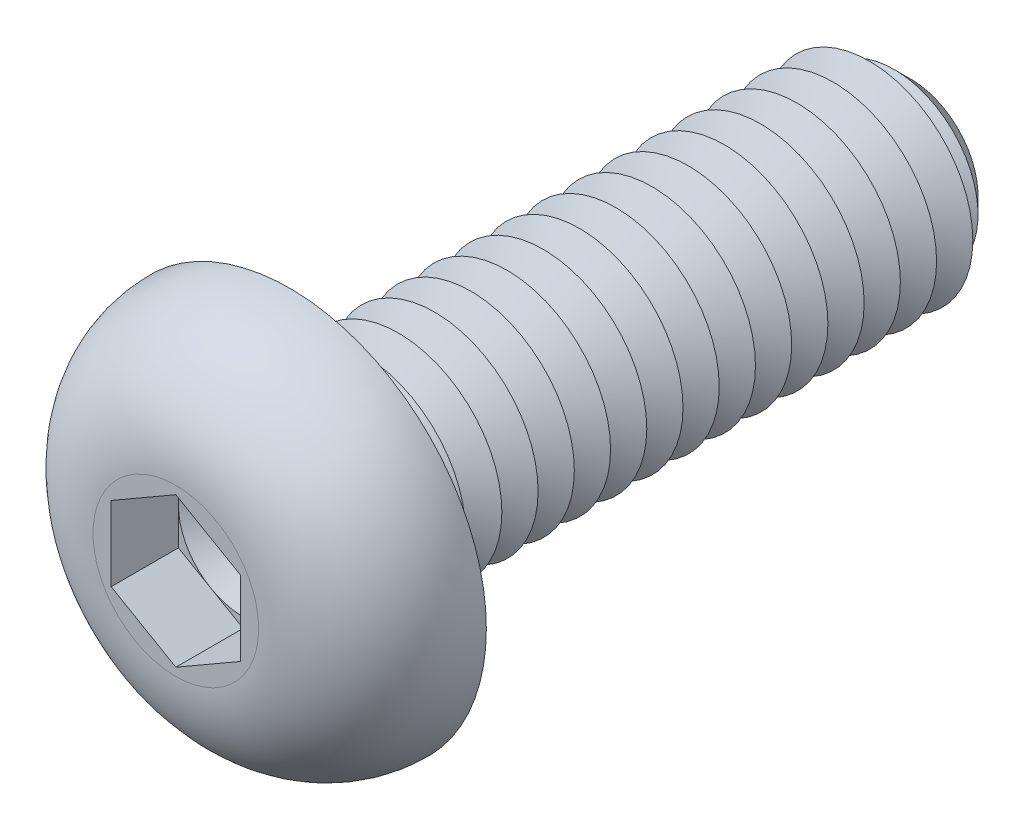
ISO-10303-21;
HEADER;
FILE_DESCRIPTION(('STEP AP214'),'2;1');
FILE_NAME('part.step','',(''),(''),'','','');
FILE_SCHEMA(('AUTOMOTIVE_DESIGN { 1 0 10303 214 1 1 1 1 }'));
ENDSEC;
DATA;
#1=APPLICATION_CONTEXT('core data for automotive mechanical design processes');
#2=APPLICATION_PROTOCOL_DEFINITION('international standard','automotive_design',2000,#1);
#3=PRODUCT_CONTEXT('',#1,'mechanical');
#4=PRODUCT('Part','Part','',(#3));
#5=PRODUCT_RELATED_PRODUCT_CATEGORY('part','',(#4));
#6=PRODUCT_DEFINITION_FORMATION('','',#4);
#7=PRODUCT_DEFINITION_CONTEXT('part definition',#1,'design');
#8=PRODUCT_DEFINITION('design','',#6,#7);
#9=PRODUCT_DEFINITION_SHAPE('','',#8);
#10=(LENGTH_UNIT() NAMED_UNIT(*) SI_UNIT(.MILLI.,.METRE.));
#11=(NAMED_UNIT(*) PLANE_ANGLE_UNIT() SI_UNIT($,.RADIAN.));
#12=(NAMED_UNIT(*) SI_UNIT($,.STERADIAN.) SOLID_ANGLE_UNIT());
#13=UNCERTAINTY_MEASURE_WITH_UNIT(LENGTH_MEASURE(1.E-05),#10,'distance_accuracy_value','');
#14=(GEOMETRIC_REPRESENTATION_CONTEXT(3) GLOBAL_UNCERTAINTY_ASSIGNED_CONTEXT((#13)) GLOBAL_UNIT_ASSIGNED_CONTEXT((#10,
#11,#12)) REPRESENTATION_CONTEXT('',''));
#15=CARTESIAN_POINT('',(0.,0.,0.));
#16=DIRECTION('',(0.,0.,1.));
#17=DIRECTION('',(1.,0.,0.));
#18=AXIS2_PLACEMENT_3D('',#15,#16,#17);
#19=CARTESIAN_POINT('',(0.,0.,0.900000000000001));
#20=DIRECTION('',(0.,0.,1.));
#21=DIRECTION('',(1.,0.,0.));
#22=AXIS2_PLACEMENT_3D('',#19,#20,#21);
#23=PLANE('',#22);
#24=CARTESIAN_POINT('',(0.,0.,0.900000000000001));
#25=DIRECTION('',(0.,0.,1.));
#26=DIRECTION('',(1.,0.,0.));
#27=AXIS2_PLACEMENT_3D('',#24,#25,#26);
#28=CIRCLE('',#27,1.25);
#29=CARTESIAN_POINT('',(1.25,0.,0.900000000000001));
#30=VERTEX_POINT('',#29);
#31=CARTESIAN_POINT('',(0.625,1.08253175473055,0.900000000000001));
#32=VERTEX_POINT('',#31);
#33=EDGE_CURVE('E117',#30,#32,#28,.T.);
#34=ORIENTED_EDGE('',*,*,#33,.F.);
#35=DIRECTION('',(0.,1.,0.));
#36=VECTOR('',#35,1.);
#37=CARTESIAN_POINT('',(1.25,-0.721687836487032,0.900000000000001));
#38=LINE('',#37,#36);
#39=CARTESIAN_POINT('',(1.25,0.721687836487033,0.900000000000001));
#40=VERTEX_POINT('',#39);
#41=EDGE_CURVE('E140',#30,#40,#38,.T.);
#42=ORIENTED_EDGE('',*,*,#41,.T.);
#43=DIRECTION('',(-0.866025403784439,0.5,0.));
#44=VECTOR('',#43,1.);
#45=CARTESIAN_POINT('',(1.25,0.721687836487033,0.900000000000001));
#46=LINE('',#45,#44);
#47=EDGE_CURVE('E135',#40,#32,#46,.T.);
#48=ORIENTED_EDGE('',*,*,#47,.T.);
#49=EDGE_LOOP('',(#34,#42,#48));
#50=FACE_BOUND('',#49,.T.);
#51=ADVANCED_FACE('F39',(#50),#23,.T.);
#52=CARTESIAN_POINT('',(0.,0.,0.900000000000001));
#53=DIRECTION('',(0.,0.,1.));
#54=DIRECTION('',(1.,0.,0.));
#55=AXIS2_PLACEMENT_3D('',#52,#53,#54);
#56=CIRCLE('',#55,1.25);
#57=CARTESIAN_POINT('',(-0.625,1.08253175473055,0.900000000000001));
#58=VERTEX_POINT('',#57);
#59=EDGE_CURVE('E11',#32,#58,#56,.T.);
#60=ORIENTED_EDGE('',*,*,#59,.F.);
#61=CARTESIAN_POINT('',(0.,1.44337567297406,0.900000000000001));
#62=VERTEX_POINT('',#61);
#63=EDGE_CURVE('E130',#32,#62,#46,.T.);
#64=ORIENTED_EDGE('',*,*,#63,.T.);
#65=DIRECTION('',(-0.866025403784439,-0.5,0.));
#66=VECTOR('',#65,1.);
#67=CARTESIAN_POINT('',(0.,1.44337567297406,0.900000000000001));
#68=LINE('',#67,#66);
#69=EDGE_CURVE('E132',#62,#58,#68,.T.);
#70=ORIENTED_EDGE('',*,*,#69,.T.);
#71=EDGE_LOOP('',(#60,#64,#70));
#72=FACE_BOUND('',#71,.T.);
#73=ADVANCED_FACE('F129',(#72),#23,.T.);
#74=CARTESIAN_POINT('',(-1.25,0.,0.900000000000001));
#75=VERTEX_POINT('',#74);
#76=EDGE_CURVE('E49',#58,#75,#56,.T.);
#77=ORIENTED_EDGE('',*,*,#76,.F.);
#78=CARTESIAN_POINT('',(-1.25,0.721687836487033,0.900000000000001));
#79=VERTEX_POINT('',#78);
#80=EDGE_CURVE('E143',#58,#79,#68,.T.);
#81=ORIENTED_EDGE('',*,*,#80,.T.);
#82=DIRECTION('',(0.,-1.,0.));
#83=VECTOR('',#82,1.);
#84=CARTESIAN_POINT('',(-1.25,0.721687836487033,0.900000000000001));
#85=LINE('',#84,#83);
#86=EDGE_CURVE('E154',#79,#75,#85,.T.);
#87=ORIENTED_EDGE('',*,*,#86,.T.);
#88=EDGE_LOOP('',(#77,#81,#87));
#89=FACE_BOUND('',#88,.T.);
#90=ADVANCED_FACE('F255',(#89),#23,.T.);
#91=CARTESIAN_POINT('',(-0.625,-1.08253175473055,0.900000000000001));
#92=VERTEX_POINT('',#91);
#93=EDGE_CURVE('E239',#75,#92,#56,.T.);
#94=ORIENTED_EDGE('',*,*,#93,.F.);
#95=CARTESIAN_POINT('',(-1.25,-0.721687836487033,0.900000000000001));
#96=VERTEX_POINT('',#95);
#97=EDGE_CURVE('E153',#75,#96,#85,.T.);
#98=ORIENTED_EDGE('',*,*,#97,.T.);
#99=DIRECTION('',(0.866025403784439,-0.5,0.));
#100=VECTOR('',#99,1.);
#101=CARTESIAN_POINT('',(-1.25,-0.721687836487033,0.900000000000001));
#102=LINE('',#101,#100);
#103=EDGE_CURVE('E159',#96,#92,#102,.T.);
#104=ORIENTED_EDGE('',*,*,#103,.T.);
#105=EDGE_LOOP('',(#94,#98,#104));
#106=FACE_BOUND('',#105,.T.);
#107=ADVANCED_FACE('F248',(#106),#23,.T.);
#108=CARTESIAN_POINT('',(0.625,-1.08253175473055,0.900000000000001));
#109=VERTEX_POINT('',#108);
#110=EDGE_CURVE('E56',#92,#109,#56,.T.);
#111=ORIENTED_EDGE('',*,*,#110,.F.);
#112=CARTESIAN_POINT('',(0.,-1.44337567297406,0.900000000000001));
#113=VERTEX_POINT('',#112);
#114=EDGE_CURVE('E158',#92,#113,#102,.T.);
#115=ORIENTED_EDGE('',*,*,#114,.T.);
#116=DIRECTION('',(0.866025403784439,0.5,0.));
#117=VECTOR('',#116,1.);
#118=CARTESIAN_POINT('',(0.,-1.44337567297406,0.900000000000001));
#119=LINE('',#118,#117);
#120=EDGE_CURVE('E164',#113,#109,#119,.T.);
#121=ORIENTED_EDGE('',*,*,#120,.T.);
#122=EDGE_LOOP('',(#111,#115,#121));
#123=FACE_BOUND('',#122,.T.);
#124=ADVANCED_FACE('F327',(#123),#23,.T.);
#125=CARTESIAN_POINT('',(0.,0.,-12.));
#126=DIRECTION('',(0.,0.,1.));
#127=DIRECTION('',(1.,0.,0.));
#128=AXIS2_PLACEMENT_3D('',#125,#126,#127);
#129=CYLINDRICAL_SURFACE('',#128,2.);
#130=CARTESIAN_POINT('',(0.,0.,-0.3));
#131=DIRECTION('',(0.,0.,1.));
#132=DIRECTION('',(1.,0.,0.));
#133=AXIS2_PLACEMENT_3D('',#130,#131,#132);
#134=CIRCLE('',#133,2.);
#135=CARTESIAN_POINT('',(2.,0.,-0.3));
#136=VERTEX_POINT('',#135);
#137=EDGE_CURVE('E221',#136,#136,#134,.F.);
#138=ORIENTED_EDGE('',*,*,#137,.T.);
#139=EDGE_LOOP('',(#138));
#140=FACE_BOUND('',#139,.T.);
#141=CARTESIAN_POINT('',(0.,0.,-0.699999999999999));
#142=DIRECTION('',(0.,0.,1.));
#143=DIRECTION('',(1.,0.,0.));
#144=AXIS2_PLACEMENT_3D('',#141,#142,#143);
#145=CIRCLE('',#144,2.);
#146=CARTESIAN_POINT('',(2.,0.,-0.699999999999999));
#147=VERTEX_POINT('',#146);
#148=EDGE_CURVE('E149',#147,#147,#145,.T.);
#149=ORIENTED_EDGE('',*,*,#148,.T.);
#150=EDGE_LOOP('',(#149));
#151=FACE_BOUND('',#150,.T.);
#152=ADVANCED_FACE('F311',(#140,#151),#129,.T.);
#153=CARTESIAN_POINT('',(0.,3.8,0.));
#154=DIRECTION('',(0.,0.,1.));
#155=DIRECTION('',(1.,0.,0.));
#156=AXIS2_PLACEMENT_3D('',#153,#154,#155);
#157=PLANE('',#156);
#158=CARTESIAN_POINT('',(0.,0.,0.));
#159=DIRECTION('',(0.,0.,1.));
#160=DIRECTION('',(1.,0.,0.));
#161=AXIS2_PLACEMENT_3D('',#158,#159,#160);
#162=CIRCLE('',#161,2.3);
#163=CARTESIAN_POINT('',(2.3,0.,0.));
#164=VERTEX_POINT('',#163);
#165=EDGE_CURVE('E230',#164,#164,#162,.T.);
#166=ORIENTED_EDGE('',*,*,#165,.T.);
#167=EDGE_LOOP('',(#166));
#168=FACE_BOUND('',#167,.T.);
#169=CARTESIAN_POINT('',(0.,0.,0.));
#170=DIRECTION('',(0.,0.,1.));
#171=DIRECTION('',(1.,0.,0.));
#172=AXIS2_PLACEMENT_3D('',#169,#170,#171);
#173=CIRCLE('',#172,3.8);
#174=CARTESIAN_POINT('',(3.8,0.,0.));
#175=VERTEX_POINT('',#174);
#176=EDGE_CURVE('E196',#175,#175,#173,.T.);
#177=ORIENTED_EDGE('',*,*,#176,.F.);
#178=EDGE_LOOP('',(#177));
#179=FACE_BOUND('',#178,.T.);
#180=ADVANCED_FACE('F357',(#168,#179),#157,.F.);
#181=CARTESIAN_POINT('',(0.,0.,2.2));
#182=DIRECTION('',(0.,0.,-1.));
#183=DIRECTION('',(-1.,0.,0.));
#184=AXIS2_PLACEMENT_3D('',#181,#182,#183);
#185=PLANE('',#184);
#186=DIRECTION('',(-0.866025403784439,-0.5,0.));
#187=VECTOR('',#186,1.);
#188=CARTESIAN_POINT('',(0.,1.44337567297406,2.2));
#189=LINE('',#188,#187);
#190=CARTESIAN_POINT('',(0.,1.44337567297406,2.2));
#191=VERTEX_POINT('',#190);
#192=CARTESIAN_POINT('',(-1.25,0.721687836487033,2.2));
#193=VERTEX_POINT('',#192);
#194=EDGE_CURVE('E174',#191,#193,#189,.T.);
#195=ORIENTED_EDGE('',*,*,#194,.F.);
#196=DIRECTION('',(-0.866025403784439,0.5,0.));
#197=VECTOR('',#196,1.);
#198=CARTESIAN_POINT('',(1.25,0.721687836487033,2.2));
#199=LINE('',#198,#197);
#200=CARTESIAN_POINT('',(1.25,0.721687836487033,2.2));
#201=VERTEX_POINT('',#200);
#202=EDGE_CURVE('E64',#201,#191,#199,.T.);
#203=ORIENTED_EDGE('',*,*,#202,.F.);
#204=DIRECTION('',(0.,1.,0.));
#205=VECTOR('',#204,1.);
#206=CARTESIAN_POINT('',(1.25,-0.721687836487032,2.2));
#207=LINE('',#206,#205);
#208=CARTESIAN_POINT('',(1.25,-0.721687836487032,2.2));
#209=VERTEX_POINT('',#208);
#210=EDGE_CURVE('E138',#209,#201,#207,.T.);
#211=ORIENTED_EDGE('',*,*,#210,.F.);
#212=DIRECTION('',(0.866025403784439,0.5,0.));
#213=VECTOR('',#212,1.);
#214=CARTESIAN_POINT('',(0.,-1.44337567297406,2.2));
#215=LINE('',#214,#213);
#216=CARTESIAN_POINT('',(0.,-1.44337567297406,2.2));
#217=VERTEX_POINT('',#216);
#218=EDGE_CURVE('E186',#217,#209,#215,.T.);
#219=ORIENTED_EDGE('',*,*,#218,.F.);
#220=DIRECTION('',(0.866025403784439,-0.5,0.));
#221=VECTOR('',#220,1.);
#222=CARTESIAN_POINT('',(-1.25,-0.721687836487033,2.2));
#223=LINE('',#222,#221);
#224=CARTESIAN_POINT('',(-1.25,-0.721687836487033,2.2));
#225=VERTEX_POINT('',#224);
#226=EDGE_CURVE('E182',#225,#217,#223,.T.);
#227=ORIENTED_EDGE('',*,*,#226,.F.);
#228=DIRECTION('',(0.,-1.,0.));
#229=VECTOR('',#228,1.);
#230=CARTESIAN_POINT('',(-1.25,0.721687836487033,2.2));
#231=LINE('',#230,#229);
#232=EDGE_CURVE('E178',#193,#225,#231,.T.);
#233=ORIENTED_EDGE('',*,*,#232,.F.);
#234=EDGE_LOOP('',(#195,#203,#211,#219,#227,#233));
#235=FACE_BOUND('',#234,.T.);
#236=CARTESIAN_POINT('',(0.,0.,2.2));
#237=DIRECTION('',(0.,0.,1.));
#238=DIRECTION('',(1.,0.,0.));
#239=AXIS2_PLACEMENT_3D('',#236,#237,#238);
#240=CIRCLE('',#239,1.6);
#241=CARTESIAN_POINT('',(1.6,0.,2.2));
#242=VERTEX_POINT('',#241);
#243=EDGE_CURVE('E213',#242,#242,#240,.T.);
#244=ORIENTED_EDGE('',*,*,#243,.T.);
#245=EDGE_LOOP('',(#244));
#246=FACE_BOUND('',#245,.T.);
#247=ADVANCED_FACE('F264',(#235,#246),#185,.F.);
#248=CARTESIAN_POINT('',(0.,0.,0.));
#249=DIRECTION('',(0.,0.,1.));
#250=DIRECTION('',(1.,0.,0.));
#251=AXIS2_PLACEMENT_3D('',#248,#249,#250);
#252=DEGENERATE_TOROIDAL_SURFACE('',#251,1.6,2.2,.T.);
#253=ORIENTED_EDGE('',*,*,#243,.F.);
#254=EDGE_LOOP('',(#253));
#255=FACE_BOUND('',#254,.T.);
#256=ORIENTED_EDGE('',*,*,#176,.T.);
#257=EDGE_LOOP('',(#256));
#258=FACE_BOUND('',#257,.T.);
#259=ADVANCED_FACE('F351',(#255,#258),#252,.T.);
#260=CARTESIAN_POINT('',(1.25,0.721687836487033,0.900000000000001));
#261=DIRECTION('',(0.5,0.866025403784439,0.));
#262=DIRECTION('',(-0.866025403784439,0.5,0.));
#263=AXIS2_PLACEMENT_3D('',#260,#261,#262);
#264=PLANE('',#263);
#265=ORIENTED_EDGE('',*,*,#202,.T.);
#266=DIRECTION('',(0.,0.,1.));
#267=VECTOR('',#266,1.);
#268=CARTESIAN_POINT('',(0.,1.44337567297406,0.900000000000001));
#269=LINE('',#268,#267);
#270=EDGE_CURVE('E136',#62,#191,#269,.T.);
#271=ORIENTED_EDGE('',*,*,#270,.F.);
#272=ORIENTED_EDGE('',*,*,#63,.F.);
#273=ORIENTED_EDGE('',*,*,#47,.F.);
#274=DIRECTION('',(0.,0.,1.));
#275=VECTOR('',#274,1.);
#276=CARTESIAN_POINT('',(1.25,0.721687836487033,0.900000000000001));
#277=LINE('',#276,#275);
#278=EDGE_CURVE('E193',#40,#201,#277,.T.);
#279=ORIENTED_EDGE('',*,*,#278,.T.);
#280=EDGE_LOOP('',(#265,#271,#272,#273,#279));
#281=FACE_BOUND('',#280,.T.);
#282=ADVANCED_FACE('F134',(#281),#264,.F.);
#283=CARTESIAN_POINT('',(1.25,-0.721687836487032,0.900000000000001));
#284=DIRECTION('',(1.,0.,0.));
#285=DIRECTION('',(0.,1.,0.));
#286=AXIS2_PLACEMENT_3D('',#283,#284,#285);
#287=PLANE('',#286);
#288=ORIENTED_EDGE('',*,*,#210,.T.);
#289=ORIENTED_EDGE('',*,*,#278,.F.);
#290=ORIENTED_EDGE('',*,*,#41,.F.);
#291=CARTESIAN_POINT('',(1.25,-0.721687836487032,0.900000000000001));
#292=VERTEX_POINT('',#291);
#293=EDGE_CURVE('E168',#292,#30,#38,.T.);
#294=ORIENTED_EDGE('',*,*,#293,.F.);
#295=DIRECTION('',(0.,0.,1.));
#296=VECTOR('',#295,1.);
#297=CARTESIAN_POINT('',(1.25,-0.721687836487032,0.900000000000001));
#298=LINE('',#297,#296);
#299=EDGE_CURVE('E197',#292,#209,#298,.T.);
#300=ORIENTED_EDGE('',*,*,#299,.T.);
#301=EDGE_LOOP('',(#288,#289,#290,#294,#300));
#302=FACE_BOUND('',#301,.T.);
#303=ADVANCED_FACE('F335',(#302),#287,.F.);
#304=CARTESIAN_POINT('',(0.,-1.44337567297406,0.900000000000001));
#305=DIRECTION('',(0.5,-0.866025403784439,0.));
#306=DIRECTION('',(0.866025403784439,0.5,0.));
#307=AXIS2_PLACEMENT_3D('',#304,#305,#306);
#308=PLANE('',#307);
#309=ORIENTED_EDGE('',*,*,#218,.T.);
#310=ORIENTED_EDGE('',*,*,#299,.F.);
#311=EDGE_CURVE('E163',#109,#292,#119,.T.);
#312=ORIENTED_EDGE('',*,*,#311,.F.);
#313=ORIENTED_EDGE('',*,*,#120,.F.);
#314=DIRECTION('',(0.,0.,1.));
#315=VECTOR('',#314,1.);
#316=CARTESIAN_POINT('',(0.,-1.44337567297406,0.900000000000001));
#317=LINE('',#316,#315);
#318=EDGE_CURVE('E200',#113,#217,#317,.T.);
#319=ORIENTED_EDGE('',*,*,#318,.T.);
#320=EDGE_LOOP('',(#309,#310,#312,#313,#319));
#321=FACE_BOUND('',#320,.T.);
#322=ADVANCED_FACE('F338',(#321),#308,.F.);
#323=CARTESIAN_POINT('',(-1.25,-0.721687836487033,0.900000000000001));
#324=DIRECTION('',(-0.5,-0.866025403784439,0.));
#325=DIRECTION('',(0.866025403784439,-0.5,0.));
#326=AXIS2_PLACEMENT_3D('',#323,#324,#325);
#327=PLANE('',#326);
#328=ORIENTED_EDGE('',*,*,#226,.T.);
#329=ORIENTED_EDGE('',*,*,#318,.F.);
#330=ORIENTED_EDGE('',*,*,#114,.F.);
#331=ORIENTED_EDGE('',*,*,#103,.F.);
#332=DIRECTION('',(0.,0.,1.));
#333=VECTOR('',#332,1.);
#334=CARTESIAN_POINT('',(-1.25,-0.721687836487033,0.900000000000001));
#335=LINE('',#334,#333);
#336=EDGE_CURVE('E203',#96,#225,#335,.T.);
#337=ORIENTED_EDGE('',*,*,#336,.T.);
#338=EDGE_LOOP('',(#328,#329,#330,#331,#337));
#339=FACE_BOUND('',#338,.T.);
#340=ADVANCED_FACE('F269',(#339),#327,.F.);
#341=CARTESIAN_POINT('',(-1.25,0.721687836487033,0.900000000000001));
#342=DIRECTION('',(-1.,0.,0.));
#343=DIRECTION('',(0.,0.,1.));
#344=AXIS2_PLACEMENT_3D('',#341,#342,#343);
#345=PLANE('',#344);
#346=ORIENTED_EDGE('',*,*,#232,.T.);
#347=ORIENTED_EDGE('',*,*,#336,.F.);
#348=ORIENTED_EDGE('',*,*,#97,.F.);
#349=ORIENTED_EDGE('',*,*,#86,.F.);
#350=DIRECTION('',(0.,0.,1.));
#351=VECTOR('',#350,1.);
#352=CARTESIAN_POINT('',(-1.25,0.721687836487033,0.900000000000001));
#353=LINE('',#352,#351);
#354=EDGE_CURVE('E206',#79,#193,#353,.T.);
#355=ORIENTED_EDGE('',*,*,#354,.T.);
#356=EDGE_LOOP('',(#346,#347,#348,#349,#355));
#357=FACE_BOUND('',#356,.T.);
#358=ADVANCED_FACE('F253',(#357),#345,.F.);
#359=CARTESIAN_POINT('',(0.,1.44337567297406,0.900000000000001));
#360=DIRECTION('',(-0.5,0.866025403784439,0.));
#361=DIRECTION('',(-0.866025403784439,-0.5,0.));
#362=AXIS2_PLACEMENT_3D('',#359,#360,#361);
#363=PLANE('',#362);
#364=ORIENTED_EDGE('',*,*,#194,.T.);
#365=ORIENTED_EDGE('',*,*,#354,.F.);
#366=ORIENTED_EDGE('',*,*,#80,.F.);
#367=ORIENTED_EDGE('',*,*,#69,.F.);
#368=ORIENTED_EDGE('',*,*,#270,.T.);
#369=EDGE_LOOP('',(#364,#365,#366,#367,#368));
#370=FACE_BOUND('',#369,.T.);
#371=ADVANCED_FACE('F258',(#370),#363,.F.);
#372=EDGE_CURVE('E43',#109,#30,#56,.T.);
#373=ORIENTED_EDGE('',*,*,#372,.F.);
#374=ORIENTED_EDGE('',*,*,#311,.T.);
#375=ORIENTED_EDGE('',*,*,#293,.T.);
#376=EDGE_LOOP('',(#373,#374,#375));
#377=FACE_BOUND('',#376,.T.);
#378=ADVANCED_FACE('F316',(#377),#23,.T.);
#379=CARTESIAN_POINT('',(0.,0.,-0.699999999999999));
#380=DIRECTION('',(0.,0.,1.));
#381=DIRECTION('',(1.,0.,0.));
#382=AXIS2_PLACEMENT_3D('',#379,#380,#381);
#383=CONICAL_SURFACE('',#382,2.,1.04719755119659);
#384=CARTESIAN_POINT('',(0.,0.,-1.05));
#385=DIRECTION('',(0.,0.,1.));
#386=DIRECTION('',(1.,0.,0.));
#387=AXIS2_PLACEMENT_3D('',#384,#385,#386);
#388=CIRCLE('',#387,1.3937822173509);
#389=CARTESIAN_POINT('',(1.3937822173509,0.,-1.05));
#390=VERTEX_POINT('',#389);
#391=EDGE_CURVE('E297',#390,#390,#388,.T.);
#392=ORIENTED_EDGE('',*,*,#391,.T.);
#393=EDGE_LOOP('',(#392));
#394=FACE_BOUND('',#393,.T.);
#395=ORIENTED_EDGE('',*,*,#148,.F.);
#396=EDGE_LOOP('',(#395));
#397=FACE_BOUND('',#396,.T.);
#398=ADVANCED_FACE('F313',(#394,#397),#383,.T.);
#399=CARTESIAN_POINT('',(0.,0.,-1.05));
#400=DIRECTION('',(0.,0.,-1.));
#401=DIRECTION('',(-1.,0.,0.));
#402=AXIS2_PLACEMENT_3D('',#399,#400,#401);
#403=CONICAL_SURFACE('',#402,1.3937822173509,1.0471975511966);
#404=CARTESIAN_POINT('',(0.,0.,-1.4));
#405=DIRECTION('',(0.,0.,1.));
#406=DIRECTION('',(1.,0.,0.));
#407=AXIS2_PLACEMENT_3D('',#404,#405,#406);
#408=CIRCLE('',#407,2.);
#409=CARTESIAN_POINT('',(2.,0.,-1.4));
#410=VERTEX_POINT('',#409);
#411=EDGE_CURVE('E290',#410,#410,#408,.T.);
#412=ORIENTED_EDGE('',*,*,#411,.T.);
#413=EDGE_LOOP('',(#412));
#414=FACE_BOUND('',#413,.T.);
#415=ORIENTED_EDGE('',*,*,#391,.F.);
#416=EDGE_LOOP('',(#415));
#417=FACE_BOUND('',#416,.T.);
#418=ADVANCED_FACE('F315',(#414,#417),#403,.T.);
#419=CARTESIAN_POINT('',(0.,0.,-1.4));
#420=DIRECTION('',(0.,0.,1.));
#421=DIRECTION('',(1.,0.,0.));
#422=AXIS2_PLACEMENT_3D('',#419,#420,#421);
#423=CONICAL_SURFACE('',#422,2.,1.04719755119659);
#424=CARTESIAN_POINT('',(0.,0.,-1.75));
#425=DIRECTION('',(0.,0.,1.));
#426=DIRECTION('',(1.,0.,0.));
#427=AXIS2_PLACEMENT_3D('',#424,#425,#426);
#428=CIRCLE('',#427,1.3937822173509);
#429=CARTESIAN_POINT('',(1.3937822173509,0.,-1.75));
#430=VERTEX_POINT('',#429);
#431=EDGE_CURVE('E288',#430,#430,#428,.T.);
#432=ORIENTED_EDGE('',*,*,#431,.T.);
#433=EDGE_LOOP('',(#432));
#434=FACE_BOUND('',#433,.T.);
#435=ORIENTED_EDGE('',*,*,#411,.F.);
#436=EDGE_LOOP('',(#435));
#437=FACE_BOUND('',#436,.T.);
#438=ADVANCED_FACE('F322',(#434,#437),#423,.T.);
#439=CARTESIAN_POINT('',(0.,0.,-1.75));
#440=DIRECTION('',(0.,0.,-1.));
#441=DIRECTION('',(-1.,0.,0.));
#442=AXIS2_PLACEMENT_3D('',#439,#440,#441);
#443=CONICAL_SURFACE('',#442,1.3937822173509,1.0471975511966);
#444=CARTESIAN_POINT('',(0.,0.,-2.1));
#445=DIRECTION('',(0.,0.,1.));
#446=DIRECTION('',(1.,0.,0.));
#447=AXIS2_PLACEMENT_3D('',#444,#445,#446);
#448=CIRCLE('',#447,2.);
#449=CARTESIAN_POINT('',(2.,0.,-2.1));
#450=VERTEX_POINT('',#449);
#451=EDGE_CURVE('E291',#450,#450,#448,.T.);
#452=ORIENTED_EDGE('',*,*,#451,.T.);
#453=EDGE_LOOP('',(#452));
#454=FACE_BOUND('',#453,.T.);
#455=ORIENTED_EDGE('',*,*,#431,.F.);
#456=EDGE_LOOP('',(#455));
#457=FACE_BOUND('',#456,.T.);
#458=ADVANCED_FACE('F484',(#454,#457),#443,.T.);
#459=CARTESIAN_POINT('',(0.,0.,-2.1));
#460=DIRECTION('',(0.,0.,1.));
#461=DIRECTION('',(1.,0.,0.));
#462=AXIS2_PLACEMENT_3D('',#459,#460,#461);
#463=CONICAL_SURFACE('',#462,2.,1.04719755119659);
#464=CARTESIAN_POINT('',(0.,0.,-2.45));
#465=DIRECTION('',(0.,0.,1.));
#466=DIRECTION('',(1.,0.,0.));
#467=AXIS2_PLACEMENT_3D('',#464,#465,#466);
#468=CIRCLE('',#467,1.3937822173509);
#469=CARTESIAN_POINT('',(1.3937822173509,0.,-2.45));
#470=VERTEX_POINT('',#469);
#471=EDGE_CURVE('E300',#470,#470,#468,.T.);
#472=ORIENTED_EDGE('',*,*,#471,.T.);
#473=EDGE_LOOP('',(#472));
#474=FACE_BOUND('',#473,.T.);
#475=ORIENTED_EDGE('',*,*,#451,.F.);
#476=EDGE_LOOP('',(#475));
#477=FACE_BOUND('',#476,.T.);
#478=ADVANCED_FACE('F469',(#474,#477),#463,.T.);
#479=CARTESIAN_POINT('',(0.,0.,-2.45));
#480=DIRECTION('',(0.,0.,-1.));
#481=DIRECTION('',(-1.,0.,0.));
#482=AXIS2_PLACEMENT_3D('',#479,#480,#481);
#483=CONICAL_SURFACE('',#482,1.3937822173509,1.0471975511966);
#484=CARTESIAN_POINT('',(0.,0.,-2.8));
#485=DIRECTION('',(0.,0.,1.));
#486=DIRECTION('',(1.,0.,0.));
#487=AXIS2_PLACEMENT_3D('',#484,#485,#486);
#488=CIRCLE('',#487,2.);
#489=CARTESIAN_POINT('',(2.,0.,-2.8));
#490=VERTEX_POINT('',#489);
#491=EDGE_CURVE('E285',#490,#490,#488,.T.);
#492=ORIENTED_EDGE('',*,*,#491,.T.);
#493=EDGE_LOOP('',(#492));
#494=FACE_BOUND('',#493,.T.);
#495=ORIENTED_EDGE('',*,*,#471,.F.);
#496=EDGE_LOOP('',(#495));
#497=FACE_BOUND('',#496,.T.);
#498=ADVANCED_FACE('F472',(#494,#497),#483,.T.);
#499=CARTESIAN_POINT('',(0.,0.,-2.8));
#500=DIRECTION('',(0.,0.,1.));
#501=DIRECTION('',(1.,0.,0.));
#502=AXIS2_PLACEMENT_3D('',#499,#500,#501);
#503=CONICAL_SURFACE('',#502,2.,1.04719755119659);
#504=CARTESIAN_POINT('',(0.,0.,-3.15));
#505=DIRECTION('',(0.,0.,1.));
#506=DIRECTION('',(1.,0.,0.));
#507=AXIS2_PLACEMENT_3D('',#504,#505,#506);
#508=CIRCLE('',#507,1.3937822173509);
#509=CARTESIAN_POINT('',(1.3937822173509,0.,-3.15));
#510=VERTEX_POINT('',#509);
#511=EDGE_CURVE('E282',#510,#510,#508,.T.);
#512=ORIENTED_EDGE('',*,*,#511,.T.);
#513=EDGE_LOOP('',(#512));
#514=FACE_BOUND('',#513,.T.);
#515=ORIENTED_EDGE('',*,*,#491,.F.);
#516=EDGE_LOOP('',(#515));
#517=FACE_BOUND('',#516,.T.);
#518=ADVANCED_FACE('F474',(#514,#517),#503,.T.);
#519=CARTESIAN_POINT('',(0.,0.,-3.15));
#520=DIRECTION('',(0.,0.,-1.));
#521=DIRECTION('',(-1.,0.,0.));
#522=AXIS2_PLACEMENT_3D('',#519,#520,#521);
#523=CONICAL_SURFACE('',#522,1.3937822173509,1.0471975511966);
#524=CARTESIAN_POINT('',(0.,0.,-3.5));
#525=DIRECTION('',(0.,0.,1.));
#526=DIRECTION('',(1.,0.,0.));
#527=AXIS2_PLACEMENT_3D('',#524,#525,#526);
#528=CIRCLE('',#527,2.);
#529=CARTESIAN_POINT('',(2.,0.,-3.5));
#530=VERTEX_POINT('',#529);
#531=EDGE_CURVE('E286',#530,#530,#528,.T.);
#532=ORIENTED_EDGE('',*,*,#531,.T.);
#533=EDGE_LOOP('',(#532));
#534=FACE_BOUND('',#533,.T.);
#535=ORIENTED_EDGE('',*,*,#511,.F.);
#536=EDGE_LOOP('',(#535));
#537=FACE_BOUND('',#536,.T.);
#538=ADVANCED_FACE('F481',(#534,#537),#523,.T.);
#539=CARTESIAN_POINT('',(0.,0.,-3.5));
#540=DIRECTION('',(0.,0.,1.));
#541=DIRECTION('',(1.,0.,0.));
#542=AXIS2_PLACEMENT_3D('',#539,#540,#541);
#543=CONICAL_SURFACE('',#542,2.,1.04719755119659);
#544=CARTESIAN_POINT('',(0.,0.,-3.85));
#545=DIRECTION('',(0.,0.,1.));
#546=DIRECTION('',(1.,0.,0.));
#547=AXIS2_PLACEMENT_3D('',#544,#545,#546);
#548=CIRCLE('',#547,1.3937822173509);
#549=CARTESIAN_POINT('',(1.3937822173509,0.,-3.85));
#550=VERTEX_POINT('',#549);
#551=EDGE_CURVE('E456',#550,#550,#548,.T.);
#552=ORIENTED_EDGE('',*,*,#551,.T.);
#553=EDGE_LOOP('',(#552));
#554=FACE_BOUND('',#553,.T.);
#555=ORIENTED_EDGE('',*,*,#531,.F.);
#556=EDGE_LOOP('',(#555));
#557=FACE_BOUND('',#556,.T.);
#558=ADVANCED_FACE('F520',(#554,#557),#543,.T.);
#559=CARTESIAN_POINT('',(0.,0.,-3.85));
#560=DIRECTION('',(0.,0.,-1.));
#561=DIRECTION('',(-1.,0.,0.));
#562=AXIS2_PLACEMENT_3D('',#559,#560,#561);
#563=CONICAL_SURFACE('',#562,1.3937822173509,1.0471975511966);
#564=CARTESIAN_POINT('',(0.,0.,-4.2));
#565=DIRECTION('',(0.,0.,1.));
#566=DIRECTION('',(1.,0.,0.));
#567=AXIS2_PLACEMENT_3D('',#564,#565,#566);
#568=CIRCLE('',#567,2.);
#569=CARTESIAN_POINT('',(2.,0.,-4.2));
#570=VERTEX_POINT('',#569);
#571=EDGE_CURVE('E452',#570,#570,#568,.T.);
#572=ORIENTED_EDGE('',*,*,#571,.T.);
#573=EDGE_LOOP('',(#572));
#574=FACE_BOUND('',#573,.T.);
#575=ORIENTED_EDGE('',*,*,#551,.F.);
#576=EDGE_LOOP('',(#575));
#577=FACE_BOUND('',#576,.T.);
#578=ADVANCED_FACE('F528',(#574,#577),#563,.T.);
#579=CARTESIAN_POINT('',(0.,0.,-4.2));
#580=DIRECTION('',(0.,0.,1.));
#581=DIRECTION('',(1.,0.,0.));
#582=AXIS2_PLACEMENT_3D('',#579,#580,#581);
#583=CONICAL_SURFACE('',#582,2.,1.04719755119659);
#584=CARTESIAN_POINT('',(0.,0.,-4.55));
#585=DIRECTION('',(0.,0.,1.));
#586=DIRECTION('',(1.,0.,0.));
#587=AXIS2_PLACEMENT_3D('',#584,#585,#586);
#588=CIRCLE('',#587,1.3937822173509);
#589=CARTESIAN_POINT('',(1.3937822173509,0.,-4.55));
#590=VERTEX_POINT('',#589);
#591=EDGE_CURVE('E449',#590,#590,#588,.T.);
#592=ORIENTED_EDGE('',*,*,#591,.T.);
#593=EDGE_LOOP('',(#592));
#594=FACE_BOUND('',#593,.T.);
#595=ORIENTED_EDGE('',*,*,#571,.F.);
#596=EDGE_LOOP('',(#595));
#597=FACE_BOUND('',#596,.T.);
#598=ADVANCED_FACE('F537',(#594,#597),#583,.T.);
#599=CARTESIAN_POINT('',(0.,0.,-4.55));
#600=DIRECTION('',(0.,0.,-1.));
#601=DIRECTION('',(-1.,0.,0.));
#602=AXIS2_PLACEMENT_3D('',#599,#600,#601);
#603=CONICAL_SURFACE('',#602,1.3937822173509,1.0471975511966);
#604=CARTESIAN_POINT('',(0.,0.,-4.9));
#605=DIRECTION('',(0.,0.,1.));
#606=DIRECTION('',(1.,0.,0.));
#607=AXIS2_PLACEMENT_3D('',#604,#605,#606);
#608=CIRCLE('',#607,2.);
#609=CARTESIAN_POINT('',(2.,0.,-4.9));
#610=VERTEX_POINT('',#609);
#611=EDGE_CURVE('E445',#610,#610,#608,.T.);
#612=ORIENTED_EDGE('',*,*,#611,.T.);
#613=EDGE_LOOP('',(#612));
#614=FACE_BOUND('',#613,.T.);
#615=ORIENTED_EDGE('',*,*,#591,.F.);
#616=EDGE_LOOP('',(#615));
#617=FACE_BOUND('',#616,.T.);
#618=ADVANCED_FACE('F546',(#614,#617),#603,.T.);
#619=CARTESIAN_POINT('',(0.,0.,-4.9));
#620=DIRECTION('',(0.,0.,1.));
#621=DIRECTION('',(1.,0.,0.));
#622=AXIS2_PLACEMENT_3D('',#619,#620,#621);
#623=CONICAL_SURFACE('',#622,2.,1.04719755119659);
#624=CARTESIAN_POINT('',(0.,0.,-5.25));
#625=DIRECTION('',(0.,0.,1.));
#626=DIRECTION('',(1.,0.,0.));
#627=AXIS2_PLACEMENT_3D('',#624,#625,#626);
#628=CIRCLE('',#627,1.3937822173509);
#629=CARTESIAN_POINT('',(1.3937822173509,0.,-5.25));
#630=VERTEX_POINT('',#629);
#631=EDGE_CURVE('E441',#630,#630,#628,.T.);
#632=ORIENTED_EDGE('',*,*,#631,.T.);
#633=EDGE_LOOP('',(#632));
#634=FACE_BOUND('',#633,.T.);
#635=ORIENTED_EDGE('',*,*,#611,.F.);
#636=EDGE_LOOP('',(#635));
#637=FACE_BOUND('',#636,.T.);
#638=ADVANCED_FACE('F555',(#634,#637),#623,.T.);
#639=CARTESIAN_POINT('',(0.,0.,-5.25));
#640=DIRECTION('',(0.,0.,-1.));
#641=DIRECTION('',(-1.,0.,0.));
#642=AXIS2_PLACEMENT_3D('',#639,#640,#641);
#643=CONICAL_SURFACE('',#642,1.3937822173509,1.0471975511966);
#644=CARTESIAN_POINT('',(0.,0.,-5.6));
#645=DIRECTION('',(0.,0.,1.));
#646=DIRECTION('',(1.,0.,0.));
#647=AXIS2_PLACEMENT_3D('',#644,#645,#646);
#648=CIRCLE('',#647,2.);
#649=CARTESIAN_POINT('',(2.,0.,-5.6));
#650=VERTEX_POINT('',#649);
#651=EDGE_CURVE('E437',#650,#650,#648,.T.);
#652=ORIENTED_EDGE('',*,*,#651,.T.);
#653=EDGE_LOOP('',(#652));
#654=FACE_BOUND('',#653,.T.);
#655=ORIENTED_EDGE('',*,*,#631,.F.);
#656=EDGE_LOOP('',(#655));
#657=FACE_BOUND('',#656,.T.);
#658=ADVANCED_FACE('F564',(#654,#657),#643,.T.);
#659=CARTESIAN_POINT('',(0.,0.,-5.6));
#660=DIRECTION('',(0.,0.,1.));
#661=DIRECTION('',(1.,0.,0.));
#662=AXIS2_PLACEMENT_3D('',#659,#660,#661);
#663=CONICAL_SURFACE('',#662,2.,1.04719755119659);
#664=CARTESIAN_POINT('',(0.,0.,-5.95));
#665=DIRECTION('',(0.,0.,1.));
#666=DIRECTION('',(1.,0.,0.));
#667=AXIS2_PLACEMENT_3D('',#664,#665,#666);
#668=CIRCLE('',#667,1.3937822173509);
#669=CARTESIAN_POINT('',(1.3937822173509,0.,-5.95));
#670=VERTEX_POINT('',#669);
#671=EDGE_CURVE('E433',#670,#670,#668,.T.);
#672=ORIENTED_EDGE('',*,*,#671,.T.);
#673=EDGE_LOOP('',(#672));
#674=FACE_BOUND('',#673,.T.);
#675=ORIENTED_EDGE('',*,*,#651,.F.);
#676=EDGE_LOOP('',(#675));
#677=FACE_BOUND('',#676,.T.);
#678=ADVANCED_FACE('F573',(#674,#677),#663,.T.);
#679=CARTESIAN_POINT('',(0.,0.,-5.95));
#680=DIRECTION('',(0.,0.,-1.));
#681=DIRECTION('',(-1.,0.,0.));
#682=AXIS2_PLACEMENT_3D('',#679,#680,#681);
#683=CONICAL_SURFACE('',#682,1.3937822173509,1.0471975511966);
#684=CARTESIAN_POINT('',(0.,0.,-6.3));
#685=DIRECTION('',(0.,0.,1.));
#686=DIRECTION('',(1.,0.,0.));
#687=AXIS2_PLACEMENT_3D('',#684,#685,#686);
#688=CIRCLE('',#687,2.);
#689=CARTESIAN_POINT('',(2.,0.,-6.3));
#690=VERTEX_POINT('',#689);
#691=EDGE_CURVE('E430',#690,#690,#688,.T.);
#692=ORIENTED_EDGE('',*,*,#691,.T.);
#693=EDGE_LOOP('',(#692));
#694=FACE_BOUND('',#693,.T.);
#695=ORIENTED_EDGE('',*,*,#671,.F.);
#696=EDGE_LOOP('',(#695));
#697=FACE_BOUND('',#696,.T.);
#698=ADVANCED_FACE('F582',(#694,#697),#683,.T.);
#699=CARTESIAN_POINT('',(0.,0.,-6.3));
#700=DIRECTION('',(0.,0.,1.));
#701=DIRECTION('',(1.,0.,0.));
#702=AXIS2_PLACEMENT_3D('',#699,#700,#701);
#703=CONICAL_SURFACE('',#702,2.,1.04719755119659);
#704=CARTESIAN_POINT('',(0.,0.,-6.65));
#705=DIRECTION('',(0.,0.,1.));
#706=DIRECTION('',(1.,0.,0.));
#707=AXIS2_PLACEMENT_3D('',#704,#705,#706);
#708=CIRCLE('',#707,1.3937822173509);
#709=CARTESIAN_POINT('',(1.3937822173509,0.,-6.65));
#710=VERTEX_POINT('',#709);
#711=EDGE_CURVE('E426',#710,#710,#708,.T.);
#712=ORIENTED_EDGE('',*,*,#711,.T.);
#713=EDGE_LOOP('',(#712));
#714=FACE_BOUND('',#713,.T.);
#715=ORIENTED_EDGE('',*,*,#691,.F.);
#716=EDGE_LOOP('',(#715));
#717=FACE_BOUND('',#716,.T.);
#718=ADVANCED_FACE('F591',(#714,#717),#703,.T.);
#719=CARTESIAN_POINT('',(0.,0.,-6.65));
#720=DIRECTION('',(0.,0.,-1.));
#721=DIRECTION('',(-1.,0.,0.));
#722=AXIS2_PLACEMENT_3D('',#719,#720,#721);
#723=CONICAL_SURFACE('',#722,1.3937822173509,1.0471975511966);
#724=CARTESIAN_POINT('',(0.,0.,-7.));
#725=DIRECTION('',(0.,0.,1.));
#726=DIRECTION('',(1.,0.,0.));
#727=AXIS2_PLACEMENT_3D('',#724,#725,#726);
#728=CIRCLE('',#727,2.);
#729=CARTESIAN_POINT('',(2.,0.,-7.));
#730=VERTEX_POINT('',#729);
#731=EDGE_CURVE('E423',#730,#730,#728,.T.);
#732=ORIENTED_EDGE('',*,*,#731,.T.);
#733=EDGE_LOOP('',(#732));
#734=FACE_BOUND('',#733,.T.);
#735=ORIENTED_EDGE('',*,*,#711,.F.);
#736=EDGE_LOOP('',(#735));
#737=FACE_BOUND('',#736,.T.);
#738=ADVANCED_FACE('F600',(#734,#737),#723,.T.);
#739=CARTESIAN_POINT('',(0.,0.,-7.));
#740=DIRECTION('',(0.,0.,1.));
#741=DIRECTION('',(1.,0.,0.));
#742=AXIS2_PLACEMENT_3D('',#739,#740,#741);
#743=CONICAL_SURFACE('',#742,2.,1.04719755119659);
#744=CARTESIAN_POINT('',(0.,0.,-7.35));
#745=DIRECTION('',(0.,0.,1.));
#746=DIRECTION('',(1.,0.,0.));
#747=AXIS2_PLACEMENT_3D('',#744,#745,#746);
#748=CIRCLE('',#747,1.3937822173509);
#749=CARTESIAN_POINT('',(1.3937822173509,0.,-7.35));
#750=VERTEX_POINT('',#749);
#751=EDGE_CURVE('E419',#750,#750,#748,.T.);
#752=ORIENTED_EDGE('',*,*,#751,.T.);
#753=EDGE_LOOP('',(#752));
#754=FACE_BOUND('',#753,.T.);
#755=ORIENTED_EDGE('',*,*,#731,.F.);
#756=EDGE_LOOP('',(#755));
#757=FACE_BOUND('',#756,.T.);
#758=ADVANCED_FACE('F609',(#754,#757),#743,.T.);
#759=CARTESIAN_POINT('',(0.,0.,-7.35));
#760=DIRECTION('',(0.,0.,-1.));
#761=DIRECTION('',(-1.,0.,0.));
#762=AXIS2_PLACEMENT_3D('',#759,#760,#761);
#763=CONICAL_SURFACE('',#762,1.3937822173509,1.0471975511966);
#764=CARTESIAN_POINT('',(0.,0.,-7.7));
#765=DIRECTION('',(0.,0.,1.));
#766=DIRECTION('',(1.,0.,0.));
#767=AXIS2_PLACEMENT_3D('',#764,#765,#766);
#768=CIRCLE('',#767,2.);
#769=CARTESIAN_POINT('',(2.,0.,-7.7));
#770=VERTEX_POINT('',#769);
#771=EDGE_CURVE('E415',#770,#770,#768,.T.);
#772=ORIENTED_EDGE('',*,*,#771,.T.);
#773=EDGE_LOOP('',(#772));
#774=FACE_BOUND('',#773,.T.);
#775=ORIENTED_EDGE('',*,*,#751,.F.);
#776=EDGE_LOOP('',(#775));
#777=FACE_BOUND('',#776,.T.);
#778=ADVANCED_FACE('F618',(#774,#777),#763,.T.);
#779=CARTESIAN_POINT('',(0.,0.,-7.7));
#780=DIRECTION('',(0.,0.,1.));
#781=DIRECTION('',(1.,0.,0.));
#782=AXIS2_PLACEMENT_3D('',#779,#780,#781);
#783=CONICAL_SURFACE('',#782,2.,1.04719755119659);
#784=CARTESIAN_POINT('',(0.,0.,-8.05));
#785=DIRECTION('',(0.,0.,1.));
#786=DIRECTION('',(1.,0.,0.));
#787=AXIS2_PLACEMENT_3D('',#784,#785,#786);
#788=CIRCLE('',#787,1.3937822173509);
#789=CARTESIAN_POINT('',(1.3937822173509,0.,-8.05));
#790=VERTEX_POINT('',#789);
#791=EDGE_CURVE('E411',#790,#790,#788,.T.);
#792=ORIENTED_EDGE('',*,*,#791,.T.);
#793=EDGE_LOOP('',(#792));
#794=FACE_BOUND('',#793,.T.);
#795=ORIENTED_EDGE('',*,*,#771,.F.);
#796=EDGE_LOOP('',(#795));
#797=FACE_BOUND('',#796,.T.);
#798=ADVANCED_FACE('F627',(#794,#797),#783,.T.);
#799=CARTESIAN_POINT('',(0.,0.,-8.05));
#800=DIRECTION('',(0.,0.,-1.));
#801=DIRECTION('',(-1.,0.,0.));
#802=AXIS2_PLACEMENT_3D('',#799,#800,#801);
#803=CONICAL_SURFACE('',#802,1.3937822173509,1.0471975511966);
#804=CARTESIAN_POINT('',(0.,0.,-8.4));
#805=DIRECTION('',(0.,0.,1.));
#806=DIRECTION('',(1.,0.,0.));
#807=AXIS2_PLACEMENT_3D('',#804,#805,#806);
#808=CIRCLE('',#807,2.);
#809=CARTESIAN_POINT('',(2.,0.,-8.4));
#810=VERTEX_POINT('',#809);
#811=EDGE_CURVE('E407',#810,#810,#808,.T.);
#812=ORIENTED_EDGE('',*,*,#811,.T.);
#813=EDGE_LOOP('',(#812));
#814=FACE_BOUND('',#813,.T.);
#815=ORIENTED_EDGE('',*,*,#791,.F.);
#816=EDGE_LOOP('',(#815));
#817=FACE_BOUND('',#816,.T.);
#818=ADVANCED_FACE('F636',(#814,#817),#803,.T.);
#819=CARTESIAN_POINT('',(0.,0.,-8.4));
#820=DIRECTION('',(0.,0.,1.));
#821=DIRECTION('',(1.,0.,0.));
#822=AXIS2_PLACEMENT_3D('',#819,#820,#821);
#823=CONICAL_SURFACE('',#822,2.,1.04719755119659);
#824=CARTESIAN_POINT('',(0.,0.,-8.75));
#825=DIRECTION('',(0.,0.,1.));
#826=DIRECTION('',(1.,0.,0.));
#827=AXIS2_PLACEMENT_3D('',#824,#825,#826);
#828=CIRCLE('',#827,1.3937822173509);
#829=CARTESIAN_POINT('',(1.3937822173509,0.,-8.75));
#830=VERTEX_POINT('',#829);
#831=EDGE_CURVE('E404',#830,#830,#828,.T.);
#832=ORIENTED_EDGE('',*,*,#831,.T.);
#833=EDGE_LOOP('',(#832));
#834=FACE_BOUND('',#833,.T.);
#835=ORIENTED_EDGE('',*,*,#811,.F.);
#836=EDGE_LOOP('',(#835));
#837=FACE_BOUND('',#836,.T.);
#838=ADVANCED_FACE('F645',(#834,#837),#823,.T.);
#839=CARTESIAN_POINT('',(0.,0.,-8.75));
#840=DIRECTION('',(0.,0.,-1.));
#841=DIRECTION('',(-1.,0.,0.));
#842=AXIS2_PLACEMENT_3D('',#839,#840,#841);
#843=CONICAL_SURFACE('',#842,1.3937822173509,1.0471975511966);
#844=CARTESIAN_POINT('',(0.,0.,-9.1));
#845=DIRECTION('',(0.,0.,1.));
#846=DIRECTION('',(1.,0.,0.));
#847=AXIS2_PLACEMENT_3D('',#844,#845,#846);
#848=CIRCLE('',#847,2.);
#849=CARTESIAN_POINT('',(2.,0.,-9.1));
#850=VERTEX_POINT('',#849);
#851=EDGE_CURVE('E400',#850,#850,#848,.T.);
#852=ORIENTED_EDGE('',*,*,#851,.T.);
#853=EDGE_LOOP('',(#852));
#854=FACE_BOUND('',#853,.T.);
#855=ORIENTED_EDGE('',*,*,#831,.F.);
#856=EDGE_LOOP('',(#855));
#857=FACE_BOUND('',#856,.T.);
#858=ADVANCED_FACE('F654',(#854,#857),#843,.T.);
#859=CARTESIAN_POINT('',(0.,0.,-9.1));
#860=DIRECTION('',(0.,0.,1.));
#861=DIRECTION('',(1.,0.,0.));
#862=AXIS2_PLACEMENT_3D('',#859,#860,#861);
#863=CONICAL_SURFACE('',#862,2.,1.04719755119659);
#864=CARTESIAN_POINT('',(0.,0.,-9.45));
#865=DIRECTION('',(0.,0.,1.));
#866=DIRECTION('',(1.,0.,0.));
#867=AXIS2_PLACEMENT_3D('',#864,#865,#866);
#868=CIRCLE('',#867,1.3937822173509);
#869=CARTESIAN_POINT('',(1.3937822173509,0.,-9.45));
#870=VERTEX_POINT('',#869);
#871=EDGE_CURVE('E279',#870,#870,#868,.T.);
#872=ORIENTED_EDGE('',*,*,#871,.T.);
#873=EDGE_LOOP('',(#872));
#874=FACE_BOUND('',#873,.T.);
#875=ORIENTED_EDGE('',*,*,#851,.F.);
#876=EDGE_LOOP('',(#875));
#877=FACE_BOUND('',#876,.T.);
#878=ADVANCED_FACE('F663',(#874,#877),#863,.T.);
#879=CARTESIAN_POINT('',(0.,0.,-9.45));
#880=DIRECTION('',(0.,0.,-1.));
#881=DIRECTION('',(-1.,0.,0.));
#882=AXIS2_PLACEMENT_3D('',#879,#880,#881);
#883=CONICAL_SURFACE('',#882,1.3937822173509,1.0471975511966);
#884=CARTESIAN_POINT('',(0.,0.,-9.8));
#885=DIRECTION('',(0.,0.,1.));
#886=DIRECTION('',(1.,0.,0.));
#887=AXIS2_PLACEMENT_3D('',#884,#885,#886);
#888=CIRCLE('',#887,2.);
#889=CARTESIAN_POINT('',(2.,0.,-9.8));
#890=VERTEX_POINT('',#889);
#891=EDGE_CURVE('E276',#890,#890,#888,.T.);
#892=ORIENTED_EDGE('',*,*,#891,.T.);
#893=EDGE_LOOP('',(#892));
#894=FACE_BOUND('',#893,.T.);
#895=ORIENTED_EDGE('',*,*,#871,.F.);
#896=EDGE_LOOP('',(#895));
#897=FACE_BOUND('',#896,.T.);
#898=ADVANCED_FACE('F672',(#894,#897),#883,.T.);
#899=CARTESIAN_POINT('',(0.,0.,-9.8));
#900=DIRECTION('',(0.,0.,1.));
#901=DIRECTION('',(1.,0.,0.));
#902=AXIS2_PLACEMENT_3D('',#899,#900,#901);
#903=CONICAL_SURFACE('',#902,2.,1.04719755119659);
#904=CARTESIAN_POINT('',(0.,0.,-10.15));
#905=DIRECTION('',(0.,0.,1.));
#906=DIRECTION('',(1.,0.,0.));
#907=AXIS2_PLACEMENT_3D('',#904,#905,#906);
#908=CIRCLE('',#907,1.3937822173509);
#909=CARTESIAN_POINT('',(1.3937822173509,0.,-10.15));
#910=VERTEX_POINT('',#909);
#911=EDGE_CURVE('E280',#910,#910,#908,.T.);
#912=ORIENTED_EDGE('',*,*,#911,.T.);
#913=EDGE_LOOP('',(#912));
#914=FACE_BOUND('',#913,.T.);
#915=ORIENTED_EDGE('',*,*,#891,.F.);
#916=EDGE_LOOP('',(#915));
#917=FACE_BOUND('',#916,.T.);
#918=ADVANCED_FACE('F681',(#914,#917),#903,.T.);
#919=CARTESIAN_POINT('',(0.,0.,-10.15));
#920=DIRECTION('',(0.,0.,-1.));
#921=DIRECTION('',(-1.,0.,0.));
#922=AXIS2_PLACEMENT_3D('',#919,#920,#921);
#923=CONICAL_SURFACE('',#922,1.3937822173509,1.0471975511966);
#924=CARTESIAN_POINT('',(0.,0.,-10.5));
#925=DIRECTION('',(0.,0.,1.));
#926=DIRECTION('',(1.,0.,0.));
#927=AXIS2_PLACEMENT_3D('',#924,#925,#926);
#928=CIRCLE('',#927,2.);
#929=CARTESIAN_POINT('',(2.,0.,-10.5));
#930=VERTEX_POINT('',#929);
#931=EDGE_CURVE('E391',#930,#930,#928,.T.);
#932=ORIENTED_EDGE('',*,*,#931,.T.);
#933=EDGE_LOOP('',(#932));
#934=FACE_BOUND('',#933,.T.);
#935=ORIENTED_EDGE('',*,*,#911,.F.);
#936=EDGE_LOOP('',(#935));
#937=FACE_BOUND('',#936,.T.);
#938=ADVANCED_FACE('F690',(#934,#937),#923,.T.);
#939=CARTESIAN_POINT('',(0.,0.,-10.5));
#940=DIRECTION('',(0.,0.,1.));
#941=DIRECTION('',(1.,0.,0.));
#942=AXIS2_PLACEMENT_3D('',#939,#940,#941);
#943=CONICAL_SURFACE('',#942,2.,1.04719755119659);
#944=CARTESIAN_POINT('',(0.,0.,-10.85));
#945=DIRECTION('',(0.,0.,1.));
#946=DIRECTION('',(1.,0.,0.));
#947=AXIS2_PLACEMENT_3D('',#944,#945,#946);
#948=CIRCLE('',#947,1.3937822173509);
#949=CARTESIAN_POINT('',(1.3937822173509,0.,-10.85));
#950=VERTEX_POINT('',#949);
#951=EDGE_CURVE('E226',#950,#950,#948,.T.);
#952=ORIENTED_EDGE('',*,*,#951,.T.);
#953=EDGE_LOOP('',(#952));
#954=FACE_BOUND('',#953,.T.);
#955=ORIENTED_EDGE('',*,*,#931,.F.);
#956=EDGE_LOOP('',(#955));
#957=FACE_BOUND('',#956,.T.);
#958=ADVANCED_FACE('F699',(#954,#957),#943,.T.);
#959=CARTESIAN_POINT('',(0.,0.,-10.85));
#960=DIRECTION('',(0.,0.,-1.));
#961=DIRECTION('',(-1.,0.,0.));
#962=AXIS2_PLACEMENT_3D('',#959,#960,#961);
#963=CONICAL_SURFACE('',#962,1.3937822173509,1.0471975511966);
#964=CARTESIAN_POINT('',(0.,0.,-11.2));
#965=DIRECTION('',(0.,0.,1.));
#966=DIRECTION('',(1.,0.,0.));
#967=AXIS2_PLACEMENT_3D('',#964,#965,#966);
#968=CIRCLE('',#967,2.);
#969=CARTESIAN_POINT('',(2.,0.,-11.2));
#970=VERTEX_POINT('',#969);
#971=EDGE_CURVE('E227',#970,#970,#968,.T.);
#972=ORIENTED_EDGE('',*,*,#971,.T.);
#973=EDGE_LOOP('',(#972));
#974=FACE_BOUND('',#973,.T.);
#975=ORIENTED_EDGE('',*,*,#951,.F.);
#976=EDGE_LOOP('',(#975));
#977=FACE_BOUND('',#976,.T.);
#978=ADVANCED_FACE('F708',(#974,#977),#963,.T.);
#979=CARTESIAN_POINT('',(0.,0.,-11.2));
#980=DIRECTION('',(0.,0.,1.));
#981=DIRECTION('',(1.,0.,0.));
#982=AXIS2_PLACEMENT_3D('',#979,#980,#981);
#983=CONICAL_SURFACE('',#982,2.,1.04719755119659);
#984=CARTESIAN_POINT('',(0.,0.,-11.55));
#985=DIRECTION('',(0.,0.,1.));
#986=DIRECTION('',(1.,0.,0.));
#987=AXIS2_PLACEMENT_3D('',#984,#985,#986);
#988=CIRCLE('',#987,1.3937822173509);
#989=CARTESIAN_POINT('',(1.3937822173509,0.,-11.55));
#990=VERTEX_POINT('',#989);
#991=EDGE_CURVE('E124',#990,#990,#988,.T.);
#992=ORIENTED_EDGE('',*,*,#991,.T.);
#993=EDGE_LOOP('',(#992));
#994=FACE_BOUND('',#993,.T.);
#995=ORIENTED_EDGE('',*,*,#971,.F.);
#996=EDGE_LOOP('',(#995));
#997=FACE_BOUND('',#996,.T.);
#998=ADVANCED_FACE('F376',(#994,#997),#983,.T.);
#999=CARTESIAN_POINT('',(0.,0.,-11.55));
#1000=DIRECTION('',(0.,0.,-1.));
#1001=DIRECTION('',(-1.,0.,0.));
#1002=AXIS2_PLACEMENT_3D('',#999,#1000,#1001);
#1003=CONICAL_SURFACE('',#1002,1.3937822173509,1.0471975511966);
#1004=CARTESIAN_POINT('',(0.,0.,-11.6803847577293));
#1005=DIRECTION('',(0.,0.,-1.));
#1006=DIRECTION('',(-1.,0.,0.));
#1007=AXIS2_PLACEMENT_3D('',#1004,#1005,#1006);
#1008=CIRCLE('',#1007,1.61961524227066);
#1009=CARTESIAN_POINT('',(-1.61961524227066,0.,-11.6803847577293));
#1010=VERTEX_POINT('',#1009);
#1011=EDGE_CURVE('E222',#1010,#1010,#1008,.T.);
#1012=ORIENTED_EDGE('',*,*,#1011,.F.);
#1013=EDGE_LOOP('',(#1012));
#1014=FACE_BOUND('',#1013,.T.);
#1015=ORIENTED_EDGE('',*,*,#991,.F.);
#1016=EDGE_LOOP('',(#1015));
#1017=FACE_BOUND('',#1016,.T.);
#1018=ADVANCED_FACE('F368',(#1014,#1017),#1003,.T.);
#1019=CARTESIAN_POINT('',(0.,0.,-12.));
#1020=DIRECTION('',(0.,0.,-1.));
#1021=DIRECTION('',(-1.,0.,0.));
#1022=AXIS2_PLACEMENT_3D('',#1019,#1020,#1021);
#1023=PLANE('',#1022);
#1024=CARTESIAN_POINT('',(0.,0.,-12.));
#1025=DIRECTION('',(0.,0.,-1.));
#1026=DIRECTION('',(-1.,0.,0.));
#1027=AXIS2_PLACEMENT_3D('',#1024,#1025,#1026);
#1028=CIRCLE('',#1027,1.3);
#1029=CARTESIAN_POINT('',(-1.3,0.,-12.));
#1030=VERTEX_POINT('',#1029);
#1031=EDGE_CURVE('E217',#1030,#1030,#1028,.T.);
#1032=ORIENTED_EDGE('',*,*,#1031,.T.);
#1033=EDGE_LOOP('',(#1032));
#1034=FACE_BOUND('',#1033,.T.);
#1035=ADVANCED_FACE('F361',(#1034),#1023,.T.);
#1036=CARTESIAN_POINT('',(0.,0.,-12.));
#1037=DIRECTION('',(0.,0.,1.));
#1038=DIRECTION('',(1.,0.,0.));
#1039=AXIS2_PLACEMENT_3D('',#1036,#1037,#1038);
#1040=CONICAL_SURFACE('',#1039,1.3,0.785398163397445);
#1041=ORIENTED_EDGE('',*,*,#1031,.F.);
#1042=EDGE_LOOP('',(#1041));
#1043=FACE_BOUND('',#1042,.T.);
#1044=ORIENTED_EDGE('',*,*,#1011,.T.);
#1045=EDGE_LOOP('',(#1044));
#1046=FACE_BOUND('',#1045,.T.);
#1047=ADVANCED_FACE('F359',(#1043,#1046),#1040,.T.);
#1048=CARTESIAN_POINT('',(0.,0.,-0.3));
#1049=DIRECTION('',(0.,0.,1.));
#1050=DIRECTION('',(1.,0.,0.));
#1051=AXIS2_PLACEMENT_3D('',#1048,#1049,#1050);
#1052=TOROIDAL_SURFACE('',#1051,2.3,0.3);
#1053=ORIENTED_EDGE('',*,*,#165,.F.);
#1054=EDGE_LOOP('',(#1053));
#1055=FACE_BOUND('',#1054,.T.);
#1056=ORIENTED_EDGE('',*,*,#137,.F.);
#1057=EDGE_LOOP('',(#1056));
#1058=FACE_BOUND('',#1057,.T.);
#1059=ADVANCED_FACE('F41',(#1055,#1058),#1052,.F.);
#1060=CARTESIAN_POINT('',(0.,0.,0.900000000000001));
#1061=DIRECTION('',(0.,0.,1.));
#1062=DIRECTION('',(1.,0.,0.));
#1063=AXIS2_PLACEMENT_3D('',#1060,#1061,#1062);
#1064=CONICAL_SURFACE('',#1063,1.25,1.0471975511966);
#1065=CARTESIAN_POINT('',(0.,0.,0.178312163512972));
#1066=VERTEX_POINT('',#1065);
#1067=VERTEX_LOOP('',#1066);
#1068=FACE_BOUND('',#1067,.T.);
#1069=ORIENTED_EDGE('',*,*,#33,.T.);
#1070=ORIENTED_EDGE('',*,*,#59,.T.);
#1071=ORIENTED_EDGE('',*,*,#76,.T.);
#1072=ORIENTED_EDGE('',*,*,#93,.T.);
#1073=ORIENTED_EDGE('',*,*,#110,.T.);
#1074=ORIENTED_EDGE('',*,*,#372,.T.);
#1075=EDGE_LOOP('',(#1069,#1070,#1071,#1072,#1073,#1074));
#1076=FACE_BOUND('',#1075,.T.);
#1077=ADVANCED_FACE('F113',(#1068,#1076),#1064,.F.);
#1078=CLOSED_SHELL('',(#51,#73,#90,#107,#124,#152,#180,#247,#259,#282,#303,#322,#340,#358,#371,
#378,#398,#418,#438,#458,#478,#498,#518,#538,#558,#578,#598,#618,#638,#658,#678,#698,#718,#738,
#758,#778,#798,#818,#838,#858,#878,#898,#918,#938,#958,#978,#998,#1018,#1035,#1047,#1059,#1077));
#1079=MANIFOLD_SOLID_BREP('B2',#1078);
#1080=ADVANCED_BREP_SHAPE_REPRESENTATION('',(#18,#1079),#14);
#1081=SHAPE_DEFINITION_REPRESENTATION(#9,#1080);
ENDSEC;
END-ISO-10303-21;
